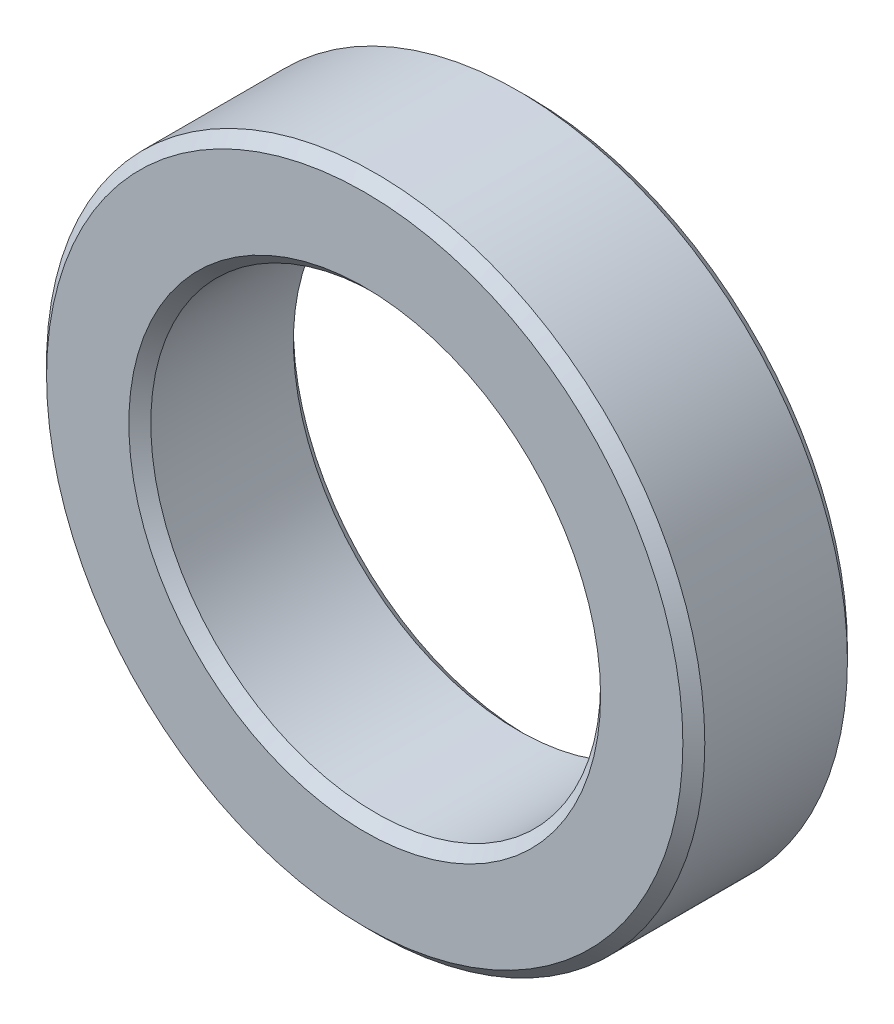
from build123d import *

# Parameters (mm, degrees)
SKETCH1_R           = 6
SKETCH1_R_2         = 4.1
BOSS_EXTRUDE2_DEPTH = 1.5
CHAMFER3_SIZE       = 0.2


with BuildPart() as part:
    # Sketch1 → Boss-Extrude2 (new, symmetric)
    with BuildSketch(Plane.XY):
        Circle(SKETCH1_R)
        Circle(SKETCH1_R_2, mode=Mode.SUBTRACT)
    extrude(amount=BOSS_EXTRUDE2_DEPTH, both=True)

    # Chamfer3
    chamfer3_edges = [part.edges().sort_by_distance(p)[0] for p in [
        (-6, 0, -1.5),
        (-6, 0, 1.5),
        (-4.1, 0, -1.5),
        (-4.1, 0, 1.5),
    ]]
    chamfer(chamfer3_edges, length=CHAMFER3_SIZE)


solid = part.part
